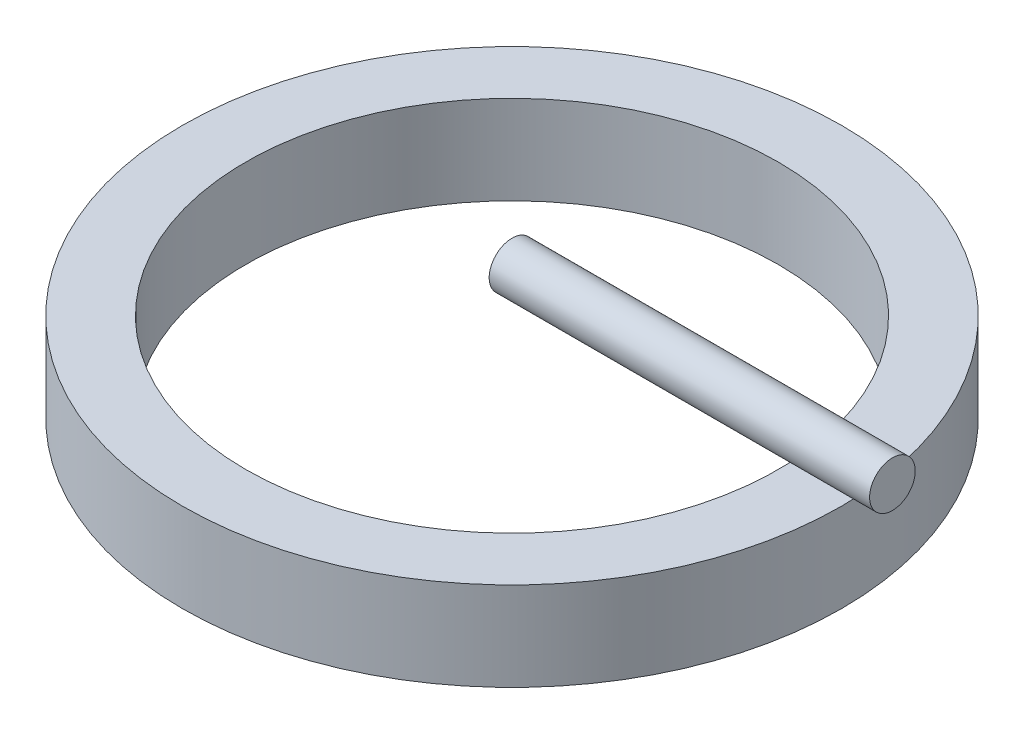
ISO-10303-21;
HEADER;
FILE_DESCRIPTION(('STEP AP214'),'2;1');
FILE_NAME('part.step','',(''),(''),'','','');
FILE_SCHEMA(('AUTOMOTIVE_DESIGN { 1 0 10303 214 1 1 1 1 }'));
ENDSEC;
DATA;
#1=APPLICATION_CONTEXT('core data for automotive mechanical design processes');
#2=APPLICATION_PROTOCOL_DEFINITION('international standard','automotive_design',2000,#1);
#3=PRODUCT_CONTEXT('',#1,'mechanical');
#4=PRODUCT('Part','Part','',(#3));
#5=PRODUCT_RELATED_PRODUCT_CATEGORY('part','',(#4));
#6=PRODUCT_DEFINITION_FORMATION('','',#4);
#7=PRODUCT_DEFINITION_CONTEXT('part definition',#1,'design');
#8=PRODUCT_DEFINITION('design','',#6,#7);
#9=PRODUCT_DEFINITION_SHAPE('','',#8);
#10=(LENGTH_UNIT() NAMED_UNIT(*) SI_UNIT(.MILLI.,.METRE.));
#11=(NAMED_UNIT(*) PLANE_ANGLE_UNIT() SI_UNIT($,.RADIAN.));
#12=(NAMED_UNIT(*) SI_UNIT($,.STERADIAN.) SOLID_ANGLE_UNIT());
#13=UNCERTAINTY_MEASURE_WITH_UNIT(LENGTH_MEASURE(1.E-05),#10,'distance_accuracy_value','');
#14=(GEOMETRIC_REPRESENTATION_CONTEXT(3) GLOBAL_UNCERTAINTY_ASSIGNED_CONTEXT((#13)) GLOBAL_UNIT_ASSIGNED_CONTEXT((#10,
#11,#12)) REPRESENTATION_CONTEXT('',''));
#15=CARTESIAN_POINT('',(0.,0.,0.));
#16=DIRECTION('',(0.,0.,1.));
#17=DIRECTION('',(1.,0.,0.));
#18=AXIS2_PLACEMENT_3D('',#15,#16,#17);
#19=CARTESIAN_POINT('',(15000.,1750.,0.));
#20=DIRECTION('',(-1.,0.,0.));
#21=DIRECTION('',(0.,0.,1.));
#22=AXIS2_PLACEMENT_3D('',#19,#20,#21);
#23=CYLINDRICAL_SURFACE('',#22,900.);
#24=CARTESIAN_POINT('',(15000.,1750.,0.));
#25=DIRECTION('',(1.,0.,0.));
#26=DIRECTION('',(0.,0.,-1.));
#27=AXIS2_PLACEMENT_3D('',#24,#25,#26);
#28=CIRCLE('',#27,900.);
#29=CARTESIAN_POINT('',(15000.,1750.,-900.));
#30=VERTEX_POINT('',#29);
#31=EDGE_CURVE('E11',#30,#30,#28,.T.);
#32=ORIENTED_EDGE('',*,*,#31,.F.);
#33=EDGE_LOOP('',(#32));
#34=FACE_BOUND('',#33,.T.);
#35=CARTESIAN_POINT('',(0.,1750.,0.));
#36=DIRECTION('',(1.,0.,0.));
#37=DIRECTION('',(0.,0.,-1.));
#38=AXIS2_PLACEMENT_3D('',#35,#36,#37);
#39=CIRCLE('',#38,900.);
#40=CARTESIAN_POINT('',(0.,1750.,-900.));
#41=VERTEX_POINT('',#40);
#42=EDGE_CURVE('E48',#41,#41,#39,.T.);
#43=ORIENTED_EDGE('',*,*,#42,.T.);
#44=EDGE_LOOP('',(#43));
#45=FACE_BOUND('',#44,.T.);
#46=ADVANCED_FACE('F44',(#34,#45),#23,.T.);
#47=CARTESIAN_POINT('',(15000.,1750.,0.));
#48=DIRECTION('',(1.,0.,0.));
#49=DIRECTION('',(0.,0.,-1.));
#50=AXIS2_PLACEMENT_3D('',#47,#48,#49);
#51=PLANE('',#50);
#52=ORIENTED_EDGE('',*,*,#31,.T.);
#53=EDGE_LOOP('',(#52));
#54=FACE_BOUND('',#53,.T.);
#55=ADVANCED_FACE('F58',(#54),#51,.T.);
#56=CARTESIAN_POINT('',(0.,1750.,0.));
#57=DIRECTION('',(1.,0.,0.));
#58=DIRECTION('',(0.,0.,-1.));
#59=AXIS2_PLACEMENT_3D('',#56,#57,#58);
#60=PLANE('',#59);
#61=ORIENTED_EDGE('',*,*,#42,.F.);
#62=EDGE_LOOP('',(#61));
#63=FACE_BOUND('',#62,.T.);
#64=ADVANCED_FACE('F59',(#63),#60,.F.);
#65=CLOSED_SHELL('',(#46,#55,#64));
#66=MANIFOLD_SOLID_BREP('B2',#65);
#67=CARTESIAN_POINT('',(0.,-3500.,0.));
#68=DIRECTION('',(0.,1.,0.));
#69=DIRECTION('',(0.,0.,1.));
#70=AXIS2_PLACEMENT_3D('',#67,#68,#69);
#71=CYLINDRICAL_SURFACE('',#70,13000.);
#72=CARTESIAN_POINT('',(0.,-3500.,0.));
#73=DIRECTION('',(0.,1.,0.));
#74=DIRECTION('',(0.,0.,1.));
#75=AXIS2_PLACEMENT_3D('',#72,#73,#74);
#76=CIRCLE('',#75,13000.);
#77=CARTESIAN_POINT('',(0.,-3500.,13000.));
#78=VERTEX_POINT('',#77);
#79=EDGE_CURVE('E42',#78,#78,#76,.T.);
#80=ORIENTED_EDGE('',*,*,#79,.T.);
#81=EDGE_LOOP('',(#80));
#82=FACE_BOUND('',#81,.T.);
#83=CARTESIAN_POINT('',(0.,0.,0.));
#84=DIRECTION('',(0.,1.,0.));
#85=DIRECTION('',(0.,0.,1.));
#86=AXIS2_PLACEMENT_3D('',#83,#84,#85);
#87=CIRCLE('',#86,13000.);
#88=CARTESIAN_POINT('',(0.,0.,13000.));
#89=VERTEX_POINT('',#88);
#90=EDGE_CURVE('E90',#89,#89,#87,.T.);
#91=ORIENTED_EDGE('',*,*,#90,.F.);
#92=EDGE_LOOP('',(#91));
#93=FACE_BOUND('',#92,.T.);
#94=ADVANCED_FACE('F88',(#82,#93),#71,.T.);
#95=CARTESIAN_POINT('',(0.,-3500.,0.));
#96=DIRECTION('',(0.,1.,0.));
#97=DIRECTION('',(0.,0.,1.));
#98=AXIS2_PLACEMENT_3D('',#95,#96,#97);
#99=PLANE('',#98);
#100=CARTESIAN_POINT('',(0.,-3500.,0.));
#101=DIRECTION('',(0.,1.,0.));
#102=DIRECTION('',(0.,0.,1.));
#103=AXIS2_PLACEMENT_3D('',#100,#101,#102);
#104=CIRCLE('',#103,10500.);
#105=CARTESIAN_POINT('',(0.,-3500.,10500.));
#106=VERTEX_POINT('',#105);
#107=EDGE_CURVE('E96',#106,#106,#104,.T.);
#108=ORIENTED_EDGE('',*,*,#107,.T.);
#109=EDGE_LOOP('',(#108));
#110=FACE_BOUND('',#109,.T.);
#111=ORIENTED_EDGE('',*,*,#79,.F.);
#112=EDGE_LOOP('',(#111));
#113=FACE_BOUND('',#112,.T.);
#114=ADVANCED_FACE('F102',(#110,#113),#99,.F.);
#115=CARTESIAN_POINT('',(0.,0.,0.));
#116=DIRECTION('',(0.,1.,0.));
#117=DIRECTION('',(0.,0.,1.));
#118=AXIS2_PLACEMENT_3D('',#115,#116,#117);
#119=PLANE('',#118);
#120=CARTESIAN_POINT('',(0.,0.,0.));
#121=DIRECTION('',(0.,1.,0.));
#122=DIRECTION('',(0.,0.,1.));
#123=AXIS2_PLACEMENT_3D('',#120,#121,#122);
#124=CIRCLE('',#123,10500.);
#125=CARTESIAN_POINT('',(0.,0.,10500.));
#126=VERTEX_POINT('',#125);
#127=EDGE_CURVE('E98',#126,#126,#124,.T.);
#128=ORIENTED_EDGE('',*,*,#127,.F.);
#129=EDGE_LOOP('',(#128));
#130=FACE_BOUND('',#129,.T.);
#131=ORIENTED_EDGE('',*,*,#90,.T.);
#132=EDGE_LOOP('',(#131));
#133=FACE_BOUND('',#132,.T.);
#134=ADVANCED_FACE('F109',(#130,#133),#119,.T.);
#135=CARTESIAN_POINT('',(0.,-3500.,0.));
#136=DIRECTION('',(0.,1.,0.));
#137=DIRECTION('',(0.,0.,1.));
#138=AXIS2_PLACEMENT_3D('',#135,#136,#137);
#139=CYLINDRICAL_SURFACE('',#138,10500.);
#140=ORIENTED_EDGE('',*,*,#107,.F.);
#141=EDGE_LOOP('',(#140));
#142=FACE_BOUND('',#141,.T.);
#143=ORIENTED_EDGE('',*,*,#127,.T.);
#144=EDGE_LOOP('',(#143));
#145=FACE_BOUND('',#144,.T.);
#146=ADVANCED_FACE('F110',(#142,#145),#139,.F.);
#147=CLOSED_SHELL('',(#94,#114,#134,#146));
#148=MANIFOLD_SOLID_BREP('B6',#147);
#149=ADVANCED_BREP_SHAPE_REPRESENTATION('',(#18,#66,#148),#14);
#150=SHAPE_DEFINITION_REPRESENTATION(#9,#149);
ENDSEC;
END-ISO-10303-21;
